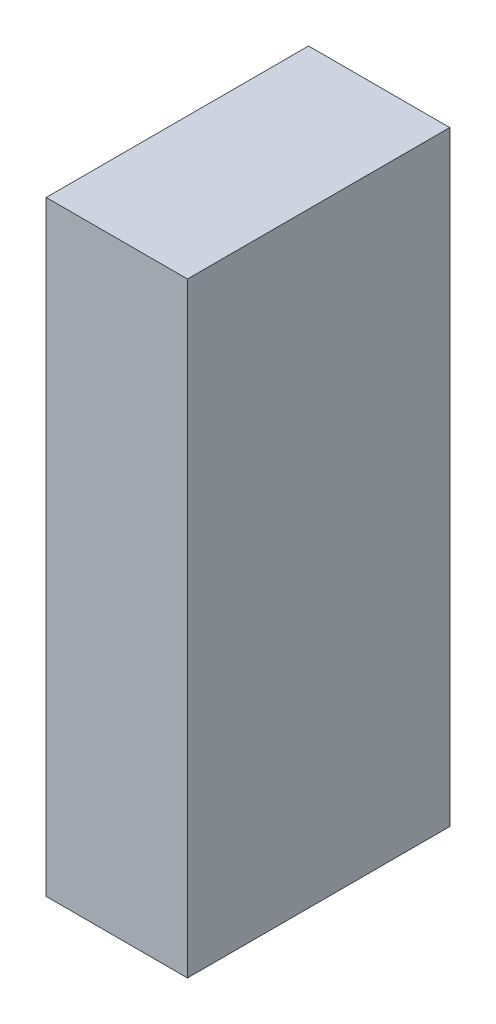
ISO-10303-21;
HEADER;
FILE_DESCRIPTION(('STEP AP214'),'2;1');
FILE_NAME('part.step','',(''),(''),'','','');
FILE_SCHEMA(('AUTOMOTIVE_DESIGN { 1 0 10303 214 1 1 1 1 }'));
ENDSEC;
DATA;
#1=APPLICATION_CONTEXT('core data for automotive mechanical design processes');
#2=APPLICATION_PROTOCOL_DEFINITION('international standard','automotive_design',2000,#1);
#3=PRODUCT_CONTEXT('',#1,'mechanical');
#4=PRODUCT('Part','Part','',(#3));
#5=PRODUCT_RELATED_PRODUCT_CATEGORY('part','',(#4));
#6=PRODUCT_DEFINITION_FORMATION('','',#4);
#7=PRODUCT_DEFINITION_CONTEXT('part definition',#1,'design');
#8=PRODUCT_DEFINITION('design','',#6,#7);
#9=PRODUCT_DEFINITION_SHAPE('','',#8);
#10=(LENGTH_UNIT() NAMED_UNIT(*) SI_UNIT(.MILLI.,.METRE.));
#11=(NAMED_UNIT(*) PLANE_ANGLE_UNIT() SI_UNIT($,.RADIAN.));
#12=(NAMED_UNIT(*) SI_UNIT($,.STERADIAN.) SOLID_ANGLE_UNIT());
#13=UNCERTAINTY_MEASURE_WITH_UNIT(LENGTH_MEASURE(1.E-05),#10,'distance_accuracy_value','');
#14=(GEOMETRIC_REPRESENTATION_CONTEXT(3) GLOBAL_UNCERTAINTY_ASSIGNED_CONTEXT((#13)) GLOBAL_UNIT_ASSIGNED_CONTEXT((#10,
#11,#12)) REPRESENTATION_CONTEXT('',''));
#15=CARTESIAN_POINT('',(0.,0.,0.));
#16=DIRECTION('',(0.,0.,1.));
#17=DIRECTION('',(1.,0.,0.));
#18=AXIS2_PLACEMENT_3D('',#15,#16,#17);
#19=CARTESIAN_POINT('',(0.,0.,65.));
#20=DIRECTION('',(1.,0.,0.));
#21=DIRECTION('',(0.,0.,-1.));
#22=AXIS2_PLACEMENT_3D('',#19,#20,#21);
#23=PLANE('',#22);
#24=DIRECTION('',(0.,-1.,0.));
#25=VECTOR('',#24,1.);
#26=CARTESIAN_POINT('',(0.,0.,0.));
#27=LINE('',#26,#25);
#28=CARTESIAN_POINT('',(0.,150.,0.));
#29=VERTEX_POINT('',#28);
#30=CARTESIAN_POINT('',(0.,0.,0.));
#31=VERTEX_POINT('',#30);
#32=EDGE_CURVE('E74',#29,#31,#27,.T.);
#33=ORIENTED_EDGE('',*,*,#32,.T.);
#34=DIRECTION('',(0.,0.,-1.));
#35=VECTOR('',#34,1.);
#36=CARTESIAN_POINT('',(0.,0.,65.));
#37=LINE('',#36,#35);
#38=CARTESIAN_POINT('',(0.,0.,65.));
#39=VERTEX_POINT('',#38);
#40=EDGE_CURVE('E11',#39,#31,#37,.T.);
#41=ORIENTED_EDGE('',*,*,#40,.F.);
#42=DIRECTION('',(0.,-1.,0.));
#43=VECTOR('',#42,1.);
#44=CARTESIAN_POINT('',(0.,0.,65.));
#45=LINE('',#44,#43);
#46=CARTESIAN_POINT('',(0.,150.,65.));
#47=VERTEX_POINT('',#46);
#48=EDGE_CURVE('E92',#47,#39,#45,.T.);
#49=ORIENTED_EDGE('',*,*,#48,.F.);
#50=DIRECTION('',(0.,0.,-1.));
#51=VECTOR('',#50,1.);
#52=CARTESIAN_POINT('',(0.,150.,65.));
#53=LINE('',#52,#51);
#54=EDGE_CURVE('E86',#47,#29,#53,.T.);
#55=ORIENTED_EDGE('',*,*,#54,.T.);
#56=EDGE_LOOP('',(#33,#41,#49,#55));
#57=FACE_BOUND('',#56,.T.);
#58=ADVANCED_FACE('F30',(#57),#23,.F.);
#59=CARTESIAN_POINT('',(0.,0.,65.));
#60=DIRECTION('',(0.,1.,0.));
#61=DIRECTION('',(0.,0.,1.));
#62=AXIS2_PLACEMENT_3D('',#59,#60,#61);
#63=PLANE('',#62);
#64=DIRECTION('',(1.,0.,0.));
#65=VECTOR('',#64,1.);
#66=CARTESIAN_POINT('',(0.,0.,0.));
#67=LINE('',#66,#65);
#68=CARTESIAN_POINT('',(35.,0.,0.));
#69=VERTEX_POINT('',#68);
#70=EDGE_CURVE('E70',#31,#69,#67,.T.);
#71=ORIENTED_EDGE('',*,*,#70,.T.);
#72=DIRECTION('',(0.,0.,-1.));
#73=VECTOR('',#72,1.);
#74=CARTESIAN_POINT('',(35.,0.,65.));
#75=LINE('',#74,#73);
#76=CARTESIAN_POINT('',(35.,0.,65.));
#77=VERTEX_POINT('',#76);
#78=EDGE_CURVE('E37',#77,#69,#75,.T.);
#79=ORIENTED_EDGE('',*,*,#78,.F.);
#80=DIRECTION('',(1.,0.,0.));
#81=VECTOR('',#80,1.);
#82=CARTESIAN_POINT('',(0.,0.,65.));
#83=LINE('',#82,#81);
#84=EDGE_CURVE('E82',#39,#77,#83,.T.);
#85=ORIENTED_EDGE('',*,*,#84,.F.);
#86=ORIENTED_EDGE('',*,*,#40,.T.);
#87=EDGE_LOOP('',(#71,#79,#85,#86));
#88=FACE_BOUND('',#87,.T.);
#89=ADVANCED_FACE('F81',(#88),#63,.F.);
#90=CARTESIAN_POINT('',(35.,0.,65.));
#91=DIRECTION('',(-1.,0.,0.));
#92=DIRECTION('',(0.,0.,1.));
#93=AXIS2_PLACEMENT_3D('',#90,#91,#92);
#94=PLANE('',#93);
#95=DIRECTION('',(0.,1.,0.));
#96=VECTOR('',#95,1.);
#97=CARTESIAN_POINT('',(35.,0.,0.));
#98=LINE('',#97,#96);
#99=CARTESIAN_POINT('',(35.,150.,0.));
#100=VERTEX_POINT('',#99);
#101=EDGE_CURVE('E75',#69,#100,#98,.T.);
#102=ORIENTED_EDGE('',*,*,#101,.T.);
#103=DIRECTION('',(0.,0.,-1.));
#104=VECTOR('',#103,1.);
#105=CARTESIAN_POINT('',(35.,150.,65.));
#106=LINE('',#105,#104);
#107=CARTESIAN_POINT('',(35.,150.,65.));
#108=VERTEX_POINT('',#107);
#109=EDGE_CURVE('E98',#108,#100,#106,.T.);
#110=ORIENTED_EDGE('',*,*,#109,.F.);
#111=DIRECTION('',(0.,1.,0.));
#112=VECTOR('',#111,1.);
#113=CARTESIAN_POINT('',(35.,0.,65.));
#114=LINE('',#113,#112);
#115=EDGE_CURVE('E49',#77,#108,#114,.T.);
#116=ORIENTED_EDGE('',*,*,#115,.F.);
#117=ORIENTED_EDGE('',*,*,#78,.T.);
#118=EDGE_LOOP('',(#102,#110,#116,#117));
#119=FACE_BOUND('',#118,.T.);
#120=ADVANCED_FACE('F101',(#119),#94,.F.);
#121=CARTESIAN_POINT('',(0.,150.,65.));
#122=DIRECTION('',(0.,-1.,0.));
#123=DIRECTION('',(0.,0.,-1.));
#124=AXIS2_PLACEMENT_3D('',#121,#122,#123);
#125=PLANE('',#124);
#126=DIRECTION('',(-1.,0.,0.));
#127=VECTOR('',#126,1.);
#128=CARTESIAN_POINT('',(0.,150.,0.));
#129=LINE('',#128,#127);
#130=EDGE_CURVE('E90',#100,#29,#129,.T.);
#131=ORIENTED_EDGE('',*,*,#130,.T.);
#132=ORIENTED_EDGE('',*,*,#54,.F.);
#133=DIRECTION('',(-1.,0.,0.));
#134=VECTOR('',#133,1.);
#135=CARTESIAN_POINT('',(0.,150.,65.));
#136=LINE('',#135,#134);
#137=EDGE_CURVE('E44',#108,#47,#136,.T.);
#138=ORIENTED_EDGE('',*,*,#137,.F.);
#139=ORIENTED_EDGE('',*,*,#109,.T.);
#140=EDGE_LOOP('',(#131,#132,#138,#139));
#141=FACE_BOUND('',#140,.T.);
#142=ADVANCED_FACE('F103',(#141),#125,.F.);
#143=CARTESIAN_POINT('',(0.,150.,65.));
#144=DIRECTION('',(0.,0.,-1.));
#145=DIRECTION('',(-1.,0.,0.));
#146=AXIS2_PLACEMENT_3D('',#143,#144,#145);
#147=PLANE('',#146);
#148=ORIENTED_EDGE('',*,*,#48,.T.);
#149=ORIENTED_EDGE('',*,*,#84,.T.);
#150=ORIENTED_EDGE('',*,*,#115,.T.);
#151=ORIENTED_EDGE('',*,*,#137,.T.);
#152=EDGE_LOOP('',(#148,#149,#150,#151));
#153=FACE_BOUND('',#152,.T.);
#154=ADVANCED_FACE('F104',(#153),#147,.F.);
#155=CARTESIAN_POINT('',(0.,150.,0.));
#156=DIRECTION('',(0.,0.,-1.));
#157=DIRECTION('',(-1.,0.,0.));
#158=AXIS2_PLACEMENT_3D('',#155,#156,#157);
#159=PLANE('',#158);
#160=ORIENTED_EDGE('',*,*,#32,.F.);
#161=ORIENTED_EDGE('',*,*,#130,.F.);
#162=ORIENTED_EDGE('',*,*,#101,.F.);
#163=ORIENTED_EDGE('',*,*,#70,.F.);
#164=EDGE_LOOP('',(#160,#161,#162,#163));
#165=FACE_BOUND('',#164,.T.);
#166=ADVANCED_FACE('F71',(#165),#159,.T.);
#167=CLOSED_SHELL('',(#58,#89,#120,#142,#154,#166));
#168=MANIFOLD_SOLID_BREP('B2',#167);
#169=ADVANCED_BREP_SHAPE_REPRESENTATION('',(#18,#168),#14);
#170=SHAPE_DEFINITION_REPRESENTATION(#9,#169);
ENDSEC;
END-ISO-10303-21;
